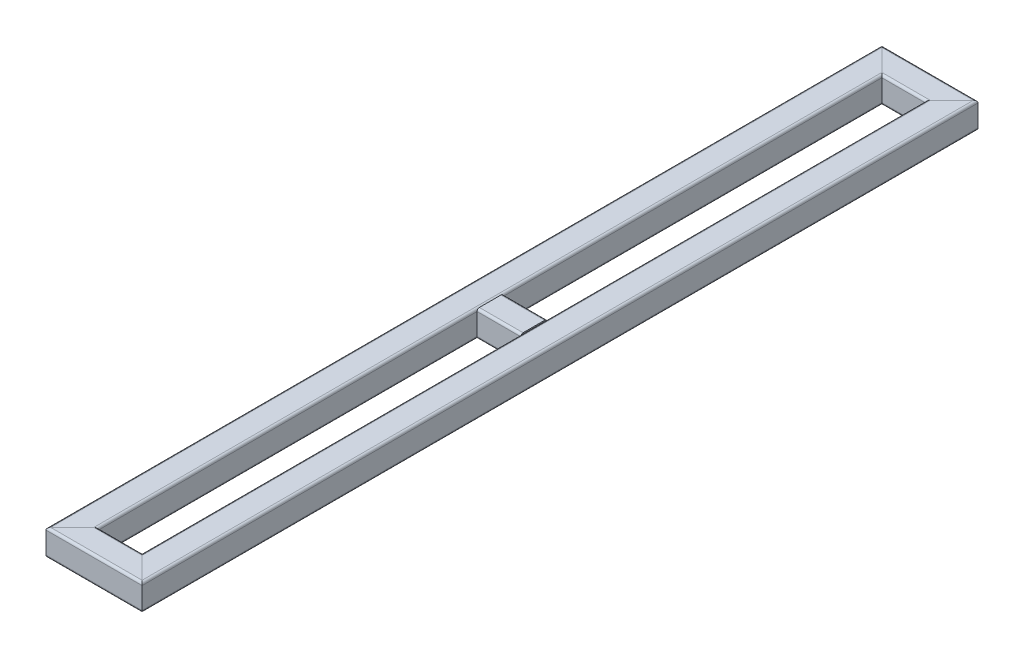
from build123d import *

# Parameters (mm, degrees)
EL_MENT_M_CANO_SOUD_1_DEPTH      = 1422.819805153
EL_MENT_M_CANO_SOUD_1_DEPTH_BACK = 32.819805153
EL_MENT_M_CANO_SOUD_1_2_DEPTH    = 185.639610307
EL_MENT_M_CANO_SOUD_1_3_DEPTH    = 1455.639610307
EL_MENT_M_CANO_SOUD_1_4_DEPTH    = 185.639610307
EL_MENT_M_CANO_SOUD_1_5_DEPTH    = 122


with BuildPart() as part:
    # Sketch11 → El_ment m_cano-soud_1 (new, two sides: drawn at the far end of the back side and taken through both)
    with BuildSketch(Plane.XY.offset(-1390).offset(-EL_MENT_M_CANO_SOUD_1_DEPTH_BACK)):
        with BuildLine():
            Line((-18.5, -22.5), (18.5, -22.5))
            ThreePointArc((18.5, -22.5), (21.328427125, -21.328427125), (22.5, -18.5))
            Line((22.5, -18.5), (22.5, 18.5))
            ThreePointArc((22.5, 18.5), (21.328427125, 21.328427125), (18.5, 22.5))
            Line((18.5, 22.5), (-18.5, 22.5))
            ThreePointArc((-18.5, 22.5), (-21.328427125, 21.328427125), (-22.5, 18.5))
            Line((-22.5, 18.5), (-22.5, -18.5))
            ThreePointArc((-22.5, -18.5), (-21.328427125, -21.328427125), (-18.5, -22.5))
        make_face()
        with BuildLine():
            Line((-18.5, -20.5), (18.5, -20.5))
            ThreePointArc((18.5, -20.5), (19.914213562, -19.914213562), (20.5, -18.5))
            Line((20.5, -18.5), (20.5, 18.5))
            ThreePointArc((20.5, 18.5), (19.914213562, 19.914213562), (18.5, 20.5))
            Line((18.5, 20.5), (-18.5, 20.5))
            ThreePointArc((-18.5, 20.5), (-19.914213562, 19.914213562), (-20.5, 18.5))
            Line((-20.5, 18.5), (-20.5, -18.5))
            ThreePointArc((-20.5, -18.5), (-19.914213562, -19.914213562), (-18.5, -20.5))
        make_face(mode=Mode.SUBTRACT)
    extrude(amount=EL_MENT_M_CANO_SOUD_1_DEPTH + EL_MENT_M_CANO_SOUD_1_DEPTH_BACK)

    # El_ment m_cano-soud_1 mitre 1
    split(bisect_by=Plane(origin=(0, 0, -1390), x_dir=(0, -1, 0), z_dir=(-0.707106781, 0, 0.707106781)), keep=Keep.TOP)

    # El_ment m_cano-soud_1 mitre 2
    split(bisect_by=Plane(origin=(0, 0, 0), x_dir=(0, -1, 0), z_dir=(-0.707106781, 0, -0.707106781)), keep=Keep.TOP)


with BuildPart() as body_2:
    # Sketch11 on segment 2 (on carried to segment 2) → El_ment m_cano-soud_1 2 (new body)
    with BuildSketch(Plane(origin=(-32.819805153, 0, 0), x_dir=(0, 0, -1), z_dir=(1, 0, 0))):
        with BuildLine():
            Line((-18.5, -22.5), (18.5, -22.5))
            ThreePointArc((18.5, -22.5), (21.328427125, -21.328427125), (22.5, -18.5))
            Line((22.5, -18.5), (22.5, 18.5))
            ThreePointArc((22.5, 18.5), (21.328427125, 21.328427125), (18.5, 22.5))
            Line((18.5, 22.5), (-18.5, 22.5))
            ThreePointArc((-18.5, 22.5), (-21.328427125, 21.328427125), (-22.5, 18.5))
            Line((-22.5, 18.5), (-22.5, -18.5))
            ThreePointArc((-22.5, -18.5), (-21.328427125, -21.328427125), (-18.5, -22.5))
        make_face()
        with BuildLine():
            Line((-18.5, -20.5), (18.5, -20.5))
            ThreePointArc((18.5, -20.5), (19.914213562, -19.914213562), (20.5, -18.5))
            Line((20.5, -18.5), (20.5, 18.5))
            ThreePointArc((20.5, 18.5), (19.914213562, 19.914213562), (18.5, 20.5))
            Line((18.5, 20.5), (-18.5, 20.5))
            ThreePointArc((-18.5, 20.5), (-19.914213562, 19.914213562), (-20.5, 18.5))
            Line((-20.5, 18.5), (-20.5, -18.5))
            ThreePointArc((-20.5, -18.5), (-19.914213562, -19.914213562), (-18.5, -20.5))
        make_face(mode=Mode.SUBTRACT)
    extrude(amount=EL_MENT_M_CANO_SOUD_1_2_DEPTH)

    # El_ment m_cano-soud_1 2 mitre 1
    split(bisect_by=Plane(origin=(0, 0, 0), x_dir=(0, 1, 0), z_dir=(0.707106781, 0, 0.707106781)), keep=Keep.TOP)

    # El_ment m_cano-soud_1 2 mitre 2
    split(bisect_by=Plane(origin=(120, 0, 0), x_dir=(0, -1, 0), z_dir=(-0.707106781, 0, 0.707106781)), keep=Keep.TOP)


with BuildPart() as body_3:
    # Sketch11 on segment 3 (on carried to segment 3) → El_ment m_cano-soud_1 3 (new body)
    with BuildSketch(Plane(origin=(120, 0, 32.819805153), x_dir=(-1, 0, 0), z_dir=(0, 0, -1))):
        with BuildLine():
            Line((-18.5, -22.5), (18.5, -22.5))
            ThreePointArc((18.5, -22.5), (21.328427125, -21.328427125), (22.5, -18.5))
            Line((22.5, -18.5), (22.5, 18.5))
            ThreePointArc((22.5, 18.5), (21.328427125, 21.328427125), (18.5, 22.5))
            Line((18.5, 22.5), (-18.5, 22.5))
            ThreePointArc((-18.5, 22.5), (-21.328427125, 21.328427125), (-22.5, 18.5))
            Line((-22.5, 18.5), (-22.5, -18.5))
            ThreePointArc((-22.5, -18.5), (-21.328427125, -21.328427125), (-18.5, -22.5))
        make_face()
        with BuildLine():
            Line((-18.5, -20.5), (18.5, -20.5))
            ThreePointArc((18.5, -20.5), (19.914213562, -19.914213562), (20.5, -18.5))
            Line((20.5, -18.5), (20.5, 18.5))
            ThreePointArc((20.5, 18.5), (19.914213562, 19.914213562), (18.5, 20.5))
            Line((18.5, 20.5), (-18.5, 20.5))
            ThreePointArc((-18.5, 20.5), (-19.914213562, 19.914213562), (-20.5, 18.5))
            Line((-20.5, 18.5), (-20.5, -18.5))
            ThreePointArc((-20.5, -18.5), (-19.914213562, -19.914213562), (-18.5, -20.5))
        make_face(mode=Mode.SUBTRACT)
    extrude(amount=EL_MENT_M_CANO_SOUD_1_3_DEPTH)

    # El_ment m_cano-soud_1 3 mitre 1
    split(bisect_by=Plane(origin=(120, 0, 0), x_dir=(0, 1, 0), z_dir=(0.707106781, 0, -0.707106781)), keep=Keep.TOP)

    # El_ment m_cano-soud_1 3 mitre 2
    split(bisect_by=Plane(origin=(120, 0, -1390), x_dir=(0, 1, 0), z_dir=(0.707106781, 0, 0.707106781)), keep=Keep.TOP)


with BuildPart() as body_4:
    # Sketch11 on segment 4 (on carried to segment 4) → El_ment m_cano-soud_1 4 (new body)
    with BuildSketch(Plane(origin=(152.819805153, 0, -1390), x_dir=(0, 0, 1), z_dir=(-1, 0, 0))):
        with BuildLine():
            Line((-18.5, -22.5), (18.5, -22.5))
            ThreePointArc((18.5, -22.5), (21.328427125, -21.328427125), (22.5, -18.5))
            Line((22.5, -18.5), (22.5, 18.5))
            ThreePointArc((22.5, 18.5), (21.328427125, 21.328427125), (18.5, 22.5))
            Line((18.5, 22.5), (-18.5, 22.5))
            ThreePointArc((-18.5, 22.5), (-21.328427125, 21.328427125), (-22.5, 18.5))
            Line((-22.5, 18.5), (-22.5, -18.5))
            ThreePointArc((-22.5, -18.5), (-21.328427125, -21.328427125), (-18.5, -22.5))
        make_face()
        with BuildLine():
            Line((-18.5, -20.5), (18.5, -20.5))
            ThreePointArc((18.5, -20.5), (19.914213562, -19.914213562), (20.5, -18.5))
            Line((20.5, -18.5), (20.5, 18.5))
            ThreePointArc((20.5, 18.5), (19.914213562, 19.914213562), (18.5, 20.5))
            Line((18.5, 20.5), (-18.5, 20.5))
            ThreePointArc((-18.5, 20.5), (-19.914213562, 19.914213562), (-20.5, 18.5))
            Line((-20.5, 18.5), (-20.5, -18.5))
            ThreePointArc((-20.5, -18.5), (-19.914213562, -19.914213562), (-18.5, -20.5))
        make_face(mode=Mode.SUBTRACT)
    extrude(amount=EL_MENT_M_CANO_SOUD_1_4_DEPTH)

    # El_ment m_cano-soud_1 4 mitre 1
    split(bisect_by=Plane(origin=(120, 0, -1390), x_dir=(0, -1, 0), z_dir=(-0.707106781, 0, -0.707106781)), keep=Keep.TOP)

    # El_ment m_cano-soud_1 4 mitre 2
    split(bisect_by=Plane(origin=(0, 0, -1390), x_dir=(0, 1, 0), z_dir=(0.707106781, 0, -0.707106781)), keep=Keep.TOP)


with BuildPart() as body_5:
    # Sketch11 on segment 5 (on carried to segment 5) → El_ment m_cano-soud_1 5 (new body)
    with BuildSketch(Plane(origin=(-1, 0, -695), x_dir=(0, 0, -1), z_dir=(1, 0, 0))):
        with BuildLine():
            Line((-18.5, -22.5), (18.5, -22.5))
            ThreePointArc((18.5, -22.5), (21.328427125, -21.328427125), (22.5, -18.5))
            Line((22.5, -18.5), (22.5, 18.5))
            ThreePointArc((22.5, 18.5), (21.328427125, 21.328427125), (18.5, 22.5))
            Line((18.5, 22.5), (-18.5, 22.5))
            ThreePointArc((-18.5, 22.5), (-21.328427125, 21.328427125), (-22.5, 18.5))
            Line((-22.5, 18.5), (-22.5, -18.5))
            ThreePointArc((-22.5, -18.5), (-21.328427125, -21.328427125), (-18.5, -22.5))
        make_face()
        with BuildLine():
            Line((-18.5, -20.5), (18.5, -20.5))
            ThreePointArc((18.5, -20.5), (19.914213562, -19.914213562), (20.5, -18.5))
            Line((20.5, -18.5), (20.5, 18.5))
            ThreePointArc((20.5, 18.5), (19.914213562, 19.914213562), (18.5, 20.5))
            Line((18.5, 20.5), (-18.5, 20.5))
            ThreePointArc((-18.5, 20.5), (-19.914213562, 19.914213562), (-20.5, 18.5))
            Line((-20.5, 18.5), (-20.5, -18.5))
            ThreePointArc((-20.5, -18.5), (-19.914213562, -19.914213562), (-18.5, -20.5))
        make_face(mode=Mode.SUBTRACT)
    extrude(amount=EL_MENT_M_CANO_SOUD_1_5_DEPTH)

    # El_ment m_cano-soud_1 5 mitre 1
    split(bisect_by=Plane(origin=(22.5, 0, -695), x_dir=(0, 1, 0), z_dir=(1, 0, 0)), keep=Keep.TOP)

    # El_ment m_cano-soud_1 5 mitre 2
    split(bisect_by=Plane(origin=(97.5, 0, -695), x_dir=(0, -1, 0), z_dir=(-1, 0, 0)), keep=Keep.TOP)


solid = Compound([part.part, body_2.part, body_3.part, body_4.part, body_5.part])
